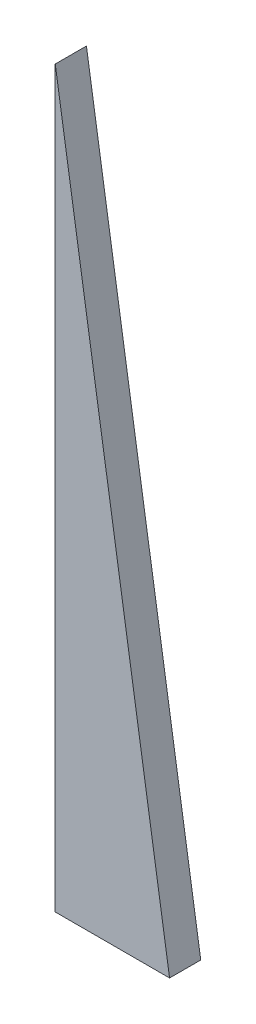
ISO-10303-21;
HEADER;
FILE_DESCRIPTION(('STEP AP214'),'2;1');
FILE_NAME('part.step','',(''),(''),'','','');
FILE_SCHEMA(('AUTOMOTIVE_DESIGN { 1 0 10303 214 1 1 1 1 }'));
ENDSEC;
DATA;
#1=APPLICATION_CONTEXT('core data for automotive mechanical design processes');
#2=APPLICATION_PROTOCOL_DEFINITION('international standard','automotive_design',2000,#1);
#3=PRODUCT_CONTEXT('',#1,'mechanical');
#4=PRODUCT('Part','Part','',(#3));
#5=PRODUCT_RELATED_PRODUCT_CATEGORY('part','',(#4));
#6=PRODUCT_DEFINITION_FORMATION('','',#4);
#7=PRODUCT_DEFINITION_CONTEXT('part definition',#1,'design');
#8=PRODUCT_DEFINITION('design','',#6,#7);
#9=PRODUCT_DEFINITION_SHAPE('','',#8);
#10=(LENGTH_UNIT() NAMED_UNIT(*) SI_UNIT(.MILLI.,.METRE.));
#11=(NAMED_UNIT(*) PLANE_ANGLE_UNIT() SI_UNIT($,.RADIAN.));
#12=(NAMED_UNIT(*) SI_UNIT($,.STERADIAN.) SOLID_ANGLE_UNIT());
#13=UNCERTAINTY_MEASURE_WITH_UNIT(LENGTH_MEASURE(1.E-05),#10,'distance_accuracy_value','');
#14=(GEOMETRIC_REPRESENTATION_CONTEXT(3) GLOBAL_UNCERTAINTY_ASSIGNED_CONTEXT((#13)) GLOBAL_UNIT_ASSIGNED_CONTEXT((#10,
#11,#12)) REPRESENTATION_CONTEXT('',''));
#15=CARTESIAN_POINT('',(0.,0.,0.));
#16=DIRECTION('',(0.,0.,1.));
#17=DIRECTION('',(1.,0.,0.));
#18=AXIS2_PLACEMENT_3D('',#15,#16,#17);
#19=CARTESIAN_POINT('',(-74.7836818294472,897.382,-2.75594527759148));
#20=DIRECTION('',(1.,0.,0.));
#21=DIRECTION('',(0.,0.,-1.));
#22=AXIS2_PLACEMENT_3D('',#19,#20,#21);
#23=PLANE('',#22);
#24=DIRECTION('',(0.,0.,1.));
#25=VECTOR('',#24,1.);
#26=CARTESIAN_POINT('',(-74.7836818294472,0.,-2.75594527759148));
#27=LINE('',#26,#25);
#28=CARTESIAN_POINT('',(-74.7836818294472,0.,-2.75594527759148));
#29=VERTEX_POINT('',#28);
#30=CARTESIAN_POINT('',(-74.7836818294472,0.,35.3440547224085));
#31=VERTEX_POINT('',#30);
#32=EDGE_CURVE('E79',#29,#31,#27,.T.);
#33=ORIENTED_EDGE('',*,*,#32,.T.);
#34=DIRECTION('',(0.,-1.,0.));
#35=VECTOR('',#34,1.);
#36=CARTESIAN_POINT('',(-74.7836818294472,897.382,35.3440547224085));
#37=LINE('',#36,#35);
#38=CARTESIAN_POINT('',(-74.7836818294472,897.382,35.3440547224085));
#39=VERTEX_POINT('',#38);
#40=EDGE_CURVE('E11',#39,#31,#37,.T.);
#41=ORIENTED_EDGE('',*,*,#40,.F.);
#42=DIRECTION('',(0.,0.,1.));
#43=VECTOR('',#42,1.);
#44=CARTESIAN_POINT('',(-74.7836818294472,897.382,-2.75594527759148));
#45=LINE('',#44,#43);
#46=CARTESIAN_POINT('',(-74.7836818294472,897.382,-2.75594527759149));
#47=VERTEX_POINT('',#46);
#48=EDGE_CURVE('E66',#47,#39,#45,.T.);
#49=ORIENTED_EDGE('',*,*,#48,.F.);
#50=DIRECTION('',(0.,-1.,0.));
#51=VECTOR('',#50,1.);
#52=CARTESIAN_POINT('',(-74.7836818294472,897.382,-2.75594527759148));
#53=LINE('',#52,#51);
#54=EDGE_CURVE('E39',#47,#29,#53,.T.);
#55=ORIENTED_EDGE('',*,*,#54,.T.);
#56=EDGE_LOOP('',(#33,#41,#49,#55));
#57=FACE_BOUND('',#56,.T.);
#58=ADVANCED_FACE('F32',(#57),#23,.F.);
#59=CARTESIAN_POINT('',(-74.7836818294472,897.382,35.3440547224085));
#60=DIRECTION('',(0.,0.,-1.));
#61=DIRECTION('',(-1.,0.,0.));
#62=AXIS2_PLACEMENT_3D('',#59,#60,#61);
#63=PLANE('',#62);
#64=DIRECTION('',(1.,0.,0.));
#65=VECTOR('',#64,1.);
#66=CARTESIAN_POINT('',(-74.7836818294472,0.,35.3440547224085));
#67=LINE('',#66,#65);
#68=CARTESIAN_POINT('',(64.9163181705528,0.,35.3440547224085));
#69=VERTEX_POINT('',#68);
#70=EDGE_CURVE('E75',#31,#69,#67,.T.);
#71=ORIENTED_EDGE('',*,*,#70,.T.);
#72=DIRECTION('',(0.153822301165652,-0.988098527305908,0.));
#73=VECTOR('',#72,1.);
#74=CARTESIAN_POINT('',(-74.7836818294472,897.382,35.3440547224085));
#75=LINE('',#74,#73);
#76=EDGE_CURVE('E54',#39,#69,#75,.T.);
#77=ORIENTED_EDGE('',*,*,#76,.F.);
#78=ORIENTED_EDGE('',*,*,#40,.T.);
#79=EDGE_LOOP('',(#71,#77,#78));
#80=FACE_BOUND('',#79,.T.);
#81=ADVANCED_FACE('F73',(#80),#63,.F.);
#82=CARTESIAN_POINT('',(-74.7836818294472,897.382,-2.75594527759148));
#83=DIRECTION('',(0.,0.,1.));
#84=DIRECTION('',(1.,0.,0.));
#85=AXIS2_PLACEMENT_3D('',#82,#83,#84);
#86=PLANE('',#85);
#87=ORIENTED_EDGE('',*,*,#54,.F.);
#88=DIRECTION('',(0.153822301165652,-0.988098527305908,0.));
#89=VECTOR('',#88,1.);
#90=CARTESIAN_POINT('',(-74.7836818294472,897.382,-2.75594527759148));
#91=LINE('',#90,#89);
#92=CARTESIAN_POINT('',(64.9163181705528,0.,-2.75594527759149));
#93=VERTEX_POINT('',#92);
#94=EDGE_CURVE('E68',#47,#93,#91,.T.);
#95=ORIENTED_EDGE('',*,*,#94,.T.);
#96=DIRECTION('',(-1.,0.,0.));
#97=VECTOR('',#96,1.);
#98=CARTESIAN_POINT('',(-74.7836818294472,0.,-2.75594527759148));
#99=LINE('',#98,#97);
#100=EDGE_CURVE('E46',#93,#29,#99,.T.);
#101=ORIENTED_EDGE('',*,*,#100,.T.);
#102=EDGE_LOOP('',(#87,#95,#101));
#103=FACE_BOUND('',#102,.T.);
#104=ADVANCED_FACE('F87',(#103),#86,.F.);
#105=CARTESIAN_POINT('',(0.,0.,0.));
#106=DIRECTION('',(0.,1.,0.));
#107=DIRECTION('',(0.,0.,1.));
#108=AXIS2_PLACEMENT_3D('',#105,#106,#107);
#109=PLANE('',#108);
#110=ORIENTED_EDGE('',*,*,#32,.F.);
#111=ORIENTED_EDGE('',*,*,#100,.F.);
#112=DIRECTION('',(0.,0.,-1.));
#113=VECTOR('',#112,1.);
#114=CARTESIAN_POINT('',(64.9163181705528,0.,-2.75594527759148));
#115=LINE('',#114,#113);
#116=EDGE_CURVE('E82',#69,#93,#115,.T.);
#117=ORIENTED_EDGE('',*,*,#116,.F.);
#118=ORIENTED_EDGE('',*,*,#70,.F.);
#119=EDGE_LOOP('',(#110,#111,#117,#118));
#120=FACE_BOUND('',#119,.T.);
#121=ADVANCED_FACE('F88',(#120),#109,.F.);
#122=CARTESIAN_POINT('',(-74.7836818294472,897.382,-734.529945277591));
#123=DIRECTION('',(-0.988098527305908,-0.153822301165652,0.));
#124=DIRECTION('',(0.153822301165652,-0.988098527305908,0.));
#125=AXIS2_PLACEMENT_3D('',#122,#123,#124);
#126=PLANE('',#125);
#127=ORIENTED_EDGE('',*,*,#48,.T.);
#128=ORIENTED_EDGE('',*,*,#76,.T.);
#129=ORIENTED_EDGE('',*,*,#116,.T.);
#130=ORIENTED_EDGE('',*,*,#94,.F.);
#131=EDGE_LOOP('',(#127,#128,#129,#130));
#132=FACE_BOUND('',#131,.T.);
#133=ADVANCED_FACE('F67',(#132),#126,.F.);
#134=CLOSED_SHELL('',(#58,#81,#104,#121,#133));
#135=MANIFOLD_SOLID_BREP('B2',#134);
#136=ADVANCED_BREP_SHAPE_REPRESENTATION('',(#18,#135),#14);
#137=SHAPE_DEFINITION_REPRESENTATION(#9,#136);
ENDSEC;
END-ISO-10303-21;
